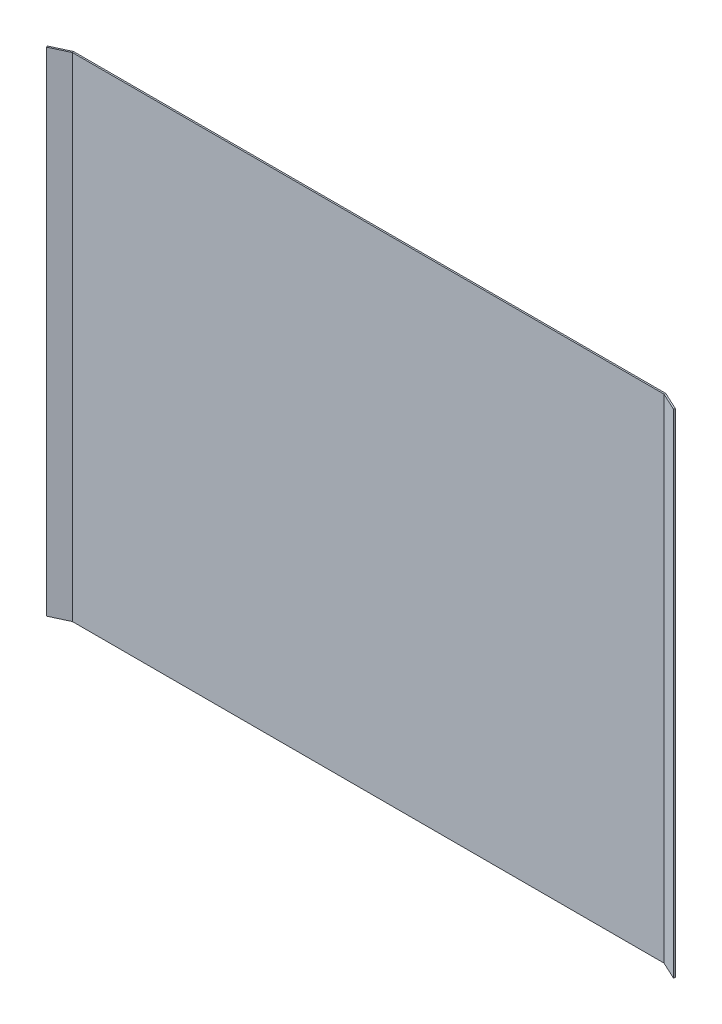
ISO-10303-21;
HEADER;
FILE_DESCRIPTION(('STEP AP214'),'2;1');
FILE_NAME('part.step','',(''),(''),'','','');
FILE_SCHEMA(('AUTOMOTIVE_DESIGN { 1 0 10303 214 1 1 1 1 }'));
ENDSEC;
DATA;
#1=APPLICATION_CONTEXT('core data for automotive mechanical design processes');
#2=APPLICATION_PROTOCOL_DEFINITION('international standard','automotive_design',2000,#1);
#3=PRODUCT_CONTEXT('',#1,'mechanical');
#4=PRODUCT('Part','Part','',(#3));
#5=PRODUCT_RELATED_PRODUCT_CATEGORY('part','',(#4));
#6=PRODUCT_DEFINITION_FORMATION('','',#4);
#7=PRODUCT_DEFINITION_CONTEXT('part definition',#1,'design');
#8=PRODUCT_DEFINITION('design','',#6,#7);
#9=PRODUCT_DEFINITION_SHAPE('','',#8);
#10=(LENGTH_UNIT() NAMED_UNIT(*) SI_UNIT(.MILLI.,.METRE.));
#11=(NAMED_UNIT(*) PLANE_ANGLE_UNIT() SI_UNIT($,.RADIAN.));
#12=(NAMED_UNIT(*) SI_UNIT($,.STERADIAN.) SOLID_ANGLE_UNIT());
#13=UNCERTAINTY_MEASURE_WITH_UNIT(LENGTH_MEASURE(1.E-05),#10,'distance_accuracy_value','');
#14=(GEOMETRIC_REPRESENTATION_CONTEXT(3) GLOBAL_UNCERTAINTY_ASSIGNED_CONTEXT((#13)) GLOBAL_UNIT_ASSIGNED_CONTEXT((#10,
#11,#12)) REPRESENTATION_CONTEXT('',''));
#15=CARTESIAN_POINT('',(0.,0.,0.));
#16=DIRECTION('',(0.,0.,1.));
#17=DIRECTION('',(1.,0.,0.));
#18=AXIS2_PLACEMENT_3D('',#15,#16,#17);
#19=CARTESIAN_POINT('',(0.,1000.,0.));
#20=DIRECTION('',(0.,0.,-1.));
#21=DIRECTION('',(-1.,0.,0.));
#22=AXIS2_PLACEMENT_3D('',#19,#20,#21);
#23=PLANE('',#22);
#24=DIRECTION('',(-1.,0.,0.));
#25=VECTOR('',#24,1.);
#26=CARTESIAN_POINT('',(0.,1000.,0.));
#27=LINE('',#26,#25);
#28=CARTESIAN_POINT('',(1240.,1000.,0.));
#29=VERTEX_POINT('',#28);
#30=CARTESIAN_POINT('',(40.,1000.,2.79997214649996E-08));
#31=VERTEX_POINT('',#30);
#32=EDGE_CURVE('E58',#29,#31,#27,.T.);
#33=ORIENTED_EDGE('',*,*,#32,.F.);
#34=DIRECTION('',(0.,-1.,0.));
#35=VECTOR('',#34,1.);
#36=CARTESIAN_POINT('',(1240.,1000.,0.));
#37=LINE('',#36,#35);
#38=CARTESIAN_POINT('',(1240.,0.,0.));
#39=VERTEX_POINT('',#38);
#40=EDGE_CURVE('E50',#29,#39,#37,.T.);
#41=ORIENTED_EDGE('',*,*,#40,.T.);
#42=DIRECTION('',(1.,0.,0.));
#43=VECTOR('',#42,1.);
#44=CARTESIAN_POINT('',(0.,0.,0.));
#45=LINE('',#44,#43);
#46=CARTESIAN_POINT('',(40.,0.,0.));
#47=VERTEX_POINT('',#46);
#48=EDGE_CURVE('E66',#47,#39,#45,.T.);
#49=ORIENTED_EDGE('',*,*,#48,.F.);
#50=DIRECTION('',(0.,-1.,0.));
#51=VECTOR('',#50,1.);
#52=CARTESIAN_POINT('',(40.,1000.,0.));
#53=LINE('',#52,#51);
#54=EDGE_CURVE('E228',#31,#47,#53,.T.);
#55=ORIENTED_EDGE('',*,*,#54,.F.);
#56=EDGE_LOOP('',(#33,#41,#49,#55));
#57=FACE_BOUND('',#56,.T.);
#58=ADVANCED_FACE('F41',(#57),#23,.T.);
#59=CARTESIAN_POINT('',(0.,1000.,3.));
#60=DIRECTION('',(0.,0.,-1.));
#61=DIRECTION('',(-1.,0.,0.));
#62=AXIS2_PLACEMENT_3D('',#59,#60,#61);
#63=PLANE('',#62);
#64=DIRECTION('',(0.,-1.,0.));
#65=VECTOR('',#64,1.);
#66=CARTESIAN_POINT('',(1240.,1000.,3.));
#67=LINE('',#66,#65);
#68=CARTESIAN_POINT('',(1240.,1000.,2.99999917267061));
#69=VERTEX_POINT('',#68);
#70=CARTESIAN_POINT('',(1240.,0.,3.));
#71=VERTEX_POINT('',#70);
#72=EDGE_CURVE('E232',#69,#71,#67,.T.);
#73=ORIENTED_EDGE('',*,*,#72,.F.);
#74=DIRECTION('',(-1.,0.,0.));
#75=VECTOR('',#74,1.);
#76=CARTESIAN_POINT('',(0.,1000.,3.));
#77=LINE('',#76,#75);
#78=CARTESIAN_POINT('',(40.,1000.,3.00000002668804));
#79=VERTEX_POINT('',#78);
#80=EDGE_CURVE('E45',#69,#79,#77,.T.);
#81=ORIENTED_EDGE('',*,*,#80,.T.);
#82=DIRECTION('',(0.,-1.,0.));
#83=VECTOR('',#82,1.);
#84=CARTESIAN_POINT('',(40.,1000.,3.));
#85=LINE('',#84,#83);
#86=CARTESIAN_POINT('',(40.,0.,3.00000002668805));
#87=VERTEX_POINT('',#86);
#88=EDGE_CURVE('E222',#79,#87,#85,.T.);
#89=ORIENTED_EDGE('',*,*,#88,.T.);
#90=DIRECTION('',(1.,0.,0.));
#91=VECTOR('',#90,1.);
#92=CARTESIAN_POINT('',(0.,0.,3.));
#93=LINE('',#92,#91);
#94=EDGE_CURVE('E240',#87,#71,#93,.T.);
#95=ORIENTED_EDGE('',*,*,#94,.T.);
#96=EDGE_LOOP('',(#73,#81,#89,#95));
#97=FACE_BOUND('',#96,.T.);
#98=ADVANCED_FACE('F245',(#97),#63,.F.);
#99=CARTESIAN_POINT('',(0.,1000.,3.));
#100=DIRECTION('',(0.,-1.,0.));
#101=DIRECTION('',(0.,0.,-1.));
#102=AXIS2_PLACEMENT_3D('',#99,#100,#101);
#103=PLANE('',#102);
#104=DIRECTION('',(0.,0.,1.));
#105=VECTOR('',#104,1.);
#106=CARTESIAN_POINT('',(1240.,1000.,3.));
#107=LINE('',#106,#105);
#108=EDGE_CURVE('E12',#29,#69,#107,.T.);
#109=ORIENTED_EDGE('',*,*,#108,.F.);
#110=ORIENTED_EDGE('',*,*,#32,.T.);
#111=DIRECTION('',(0.,0.,1.));
#112=VECTOR('',#111,1.);
#113=CARTESIAN_POINT('',(40.,1000.,3.));
#114=LINE('',#113,#112);
#115=EDGE_CURVE('E225',#31,#79,#114,.T.);
#116=ORIENTED_EDGE('',*,*,#115,.T.);
#117=ORIENTED_EDGE('',*,*,#80,.F.);
#118=EDGE_LOOP('',(#109,#110,#116,#117));
#119=FACE_BOUND('',#118,.T.);
#120=ADVANCED_FACE('F43',(#119),#103,.F.);
#121=CARTESIAN_POINT('',(0.,0.,3.));
#122=DIRECTION('',(0.,1.,0.));
#123=DIRECTION('',(0.,0.,1.));
#124=AXIS2_PLACEMENT_3D('',#121,#122,#123);
#125=PLANE('',#124);
#126=DIRECTION('',(0.,0.,-1.));
#127=VECTOR('',#126,1.);
#128=CARTESIAN_POINT('',(1240.,0.,3.));
#129=LINE('',#128,#127);
#130=EDGE_CURVE('E235',#71,#39,#129,.T.);
#131=ORIENTED_EDGE('',*,*,#130,.F.);
#132=ORIENTED_EDGE('',*,*,#94,.F.);
#133=DIRECTION('',(0.,0.,-1.));
#134=VECTOR('',#133,1.);
#135=CARTESIAN_POINT('',(40.0000000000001,0.,3.));
#136=LINE('',#135,#134);
#137=EDGE_CURVE('E230',#87,#47,#136,.T.);
#138=ORIENTED_EDGE('',*,*,#137,.T.);
#139=ORIENTED_EDGE('',*,*,#48,.T.);
#140=EDGE_LOOP('',(#131,#132,#138,#139));
#141=FACE_BOUND('',#140,.T.);
#142=ADVANCED_FACE('F286',(#141),#125,.F.);
#143=CARTESIAN_POINT('',(40.,1000.,4.09999997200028));
#144=DIRECTION('',(0.,-1.,0.));
#145=DIRECTION('',(0.,0.,-1.));
#146=AXIS2_PLACEMENT_3D('',#143,#144,#145);
#147=PLANE('',#146);
#148=ORIENTED_EDGE('',*,*,#115,.F.);
#149=CARTESIAN_POINT('',(40.,1000.,4.1));
#150=DIRECTION('',(0.,-1.,0.));
#151=DIRECTION('',(1.,0.,0.));
#152=AXIS2_PLACEMENT_3D('',#149,#150,#151);
#153=CIRCLE('',#152,4.09999997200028);
#154=CARTESIAN_POINT('',(38.2672651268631,1000.,0.384138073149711));
#155=VERTEX_POINT('',#154);
#156=EDGE_CURVE('E180',#31,#155,#153,.F.);
#157=ORIENTED_EDGE('',*,*,#156,.T.);
#158=DIRECTION('',(0.4226182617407,0.,0.90630778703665));
#159=VECTOR('',#158,1.);
#160=CARTESIAN_POINT('',(39.5351199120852,1000.,3.10306143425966));
#161=LINE('',#160,#159);
#162=CARTESIAN_POINT('',(39.5351199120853,1000.,3.10306143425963));
#163=VERTEX_POINT('',#162);
#164=EDGE_CURVE('E203',#155,#163,#161,.T.);
#165=ORIENTED_EDGE('',*,*,#164,.T.);
#166=CARTESIAN_POINT('',(40.,1000.,4.09999997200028));
#167=DIRECTION('',(0.,1.,0.));
#168=DIRECTION('',(0.,0.,1.));
#169=AXIS2_PLACEMENT_3D('',#166,#167,#168);
#170=CIRCLE('',#169,1.09999994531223);
#171=EDGE_CURVE('E214',#79,#163,#170,.T.);
#172=ORIENTED_EDGE('',*,*,#171,.F.);
#173=EDGE_LOOP('',(#148,#157,#165,#172));
#174=FACE_BOUND('',#173,.T.);
#175=ADVANCED_FACE('F250',(#174),#147,.F.);
#176=CARTESIAN_POINT('',(40.0000000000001,0.,4.09999997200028));
#177=DIRECTION('',(0.,1.,0.));
#178=DIRECTION('',(-1.,0.,0.));
#179=AXIS2_PLACEMENT_3D('',#176,#177,#178);
#180=PLANE('',#179);
#181=DIRECTION('',(-0.4226182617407,0.,-0.90630778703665));
#182=VECTOR('',#181,1.);
#183=CARTESIAN_POINT('',(39.5351199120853,0.,3.10306143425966));
#184=LINE('',#183,#182);
#185=CARTESIAN_POINT('',(39.5351199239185,0.,3.10306145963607));
#186=VERTEX_POINT('',#185);
#187=CARTESIAN_POINT('',(38.2672651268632,0.,0.384138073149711));
#188=VERTEX_POINT('',#187);
#189=EDGE_CURVE('E206',#186,#188,#184,.T.);
#190=ORIENTED_EDGE('',*,*,#189,.T.);
#191=CARTESIAN_POINT('',(40.0000000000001,0.,4.1));
#192=DIRECTION('',(0.,-1.,0.));
#193=DIRECTION('',(1.,0.,0.));
#194=AXIS2_PLACEMENT_3D('',#191,#192,#193);
#195=CIRCLE('',#194,4.09999997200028);
#196=EDGE_CURVE('E211',#188,#47,#195,.T.);
#197=ORIENTED_EDGE('',*,*,#196,.T.);
#198=ORIENTED_EDGE('',*,*,#137,.F.);
#199=CARTESIAN_POINT('',(40.0000000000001,0.,4.09999997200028));
#200=DIRECTION('',(0.,-1.,0.));
#201=DIRECTION('',(1.,0.,0.));
#202=AXIS2_PLACEMENT_3D('',#199,#200,#201);
#203=CIRCLE('',#202,1.09999994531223);
#204=EDGE_CURVE('E219',#186,#87,#203,.T.);
#205=ORIENTED_EDGE('',*,*,#204,.F.);
#206=EDGE_LOOP('',(#190,#197,#198,#205));
#207=FACE_BOUND('',#206,.T.);
#208=ADVANCED_FACE('F261',(#207),#180,.F.);
#209=CARTESIAN_POINT('',(39.9999999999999,1500.00491580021,4.1));
#210=DIRECTION('',(0.,-1.,0.));
#211=DIRECTION('',(1.,0.,0.));
#212=AXIS2_PLACEMENT_3D('',#209,#210,#211);
#213=CYLINDRICAL_SURFACE('',#212,1.09999997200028);
#214=ORIENTED_EDGE('',*,*,#204,.T.);
#215=ORIENTED_EDGE('',*,*,#88,.F.);
#216=ORIENTED_EDGE('',*,*,#171,.T.);
#217=DIRECTION('',(0.,-1.,0.));
#218=VECTOR('',#217,1.);
#219=CARTESIAN_POINT('',(39.5351199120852,1000.,3.10306143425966));
#220=LINE('',#219,#218);
#221=EDGE_CURVE('E177',#163,#186,#220,.T.);
#222=ORIENTED_EDGE('',*,*,#221,.T.);
#223=EDGE_LOOP('',(#214,#215,#216,#222));
#224=FACE_BOUND('',#223,.T.);
#225=ADVANCED_FACE('F270',(#224),#213,.F.);
#226=CARTESIAN_POINT('',(39.9999999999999,1500.00491580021,4.1));
#227=DIRECTION('',(0.,-1.,0.));
#228=DIRECTION('',(1.,0.,0.));
#229=AXIS2_PLACEMENT_3D('',#226,#227,#228);
#230=CYLINDRICAL_SURFACE('',#229,4.09999997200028);
#231=ORIENTED_EDGE('',*,*,#196,.F.);
#232=DIRECTION('',(0.,-1.,0.));
#233=VECTOR('',#232,1.);
#234=CARTESIAN_POINT('',(38.2672651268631,1000.,0.384138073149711));
#235=LINE('',#234,#233);
#236=EDGE_CURVE('E184',#155,#188,#235,.T.);
#237=ORIENTED_EDGE('',*,*,#236,.F.);
#238=ORIENTED_EDGE('',*,*,#156,.F.);
#239=ORIENTED_EDGE('',*,*,#54,.T.);
#240=EDGE_LOOP('',(#231,#237,#238,#239));
#241=FACE_BOUND('',#240,.T.);
#242=ADVANCED_FACE('F254',(#241),#230,.T.);
#243=CARTESIAN_POINT('',(4.10930180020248,0.,19.6223917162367));
#244=DIRECTION('',(0.90630778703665,0.,-0.4226182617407));
#245=DIRECTION('',(-0.4226182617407,0.,-0.90630778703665));
#246=AXIS2_PLACEMENT_3D('',#243,#244,#245);
#247=PLANE('',#246);
#248=DIRECTION('',(0.,-1.,0.));
#249=VECTOR('',#248,1.);
#250=CARTESIAN_POINT('',(2.84144701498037,0.,16.9034683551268));
#251=LINE('',#250,#249);
#252=CARTESIAN_POINT('',(2.84144701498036,1000.,16.9034683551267));
#253=VERTEX_POINT('',#252);
#254=CARTESIAN_POINT('',(2.84144701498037,0.,16.9034683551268));
#255=VERTEX_POINT('',#254);
#256=EDGE_CURVE('E200',#253,#255,#251,.T.);
#257=ORIENTED_EDGE('',*,*,#256,.T.);
#258=DIRECTION('',(-0.4226182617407,0.,-0.90630778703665));
#259=VECTOR('',#258,1.);
#260=CARTESIAN_POINT('',(4.10930180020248,0.,19.6223917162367));
#261=LINE('',#260,#259);
#262=CARTESIAN_POINT('',(4.10930180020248,0.,19.6223917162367));
#263=VERTEX_POINT('',#262);
#264=EDGE_CURVE('E181',#263,#255,#261,.T.);
#265=ORIENTED_EDGE('',*,*,#264,.F.);
#266=DIRECTION('',(0.,-1.,0.));
#267=VECTOR('',#266,1.);
#268=CARTESIAN_POINT('',(4.10930180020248,0.,19.6223917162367));
#269=LINE('',#268,#267);
#270=CARTESIAN_POINT('',(4.10930180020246,1000.,19.6223917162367));
#271=VERTEX_POINT('',#270);
#272=EDGE_CURVE('E192',#271,#263,#269,.T.);
#273=ORIENTED_EDGE('',*,*,#272,.F.);
#274=DIRECTION('',(-0.4226182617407,0.,-0.90630778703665));
#275=VECTOR('',#274,1.);
#276=CARTESIAN_POINT('',(4.10930180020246,1000.,19.6223917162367));
#277=LINE('',#276,#275);
#278=EDGE_CURVE('E197',#271,#253,#277,.T.);
#279=ORIENTED_EDGE('',*,*,#278,.T.);
#280=EDGE_LOOP('',(#257,#265,#273,#279));
#281=FACE_BOUND('',#280,.T.);
#282=ADVANCED_FACE('F277',(#281),#247,.F.);
#283=CARTESIAN_POINT('',(4.10930180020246,1000.,19.6223917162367));
#284=DIRECTION('',(-0.4226182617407,0.,-0.90630778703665));
#285=DIRECTION('',(-0.90630778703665,0.,0.4226182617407));
#286=AXIS2_PLACEMENT_3D('',#283,#284,#285);
#287=PLANE('',#286);
#288=ORIENTED_EDGE('',*,*,#221,.F.);
#289=DIRECTION('',(-0.90630778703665,0.,0.4226182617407));
#290=VECTOR('',#289,1.);
#291=CARTESIAN_POINT('',(4.10930180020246,1000.,19.6223917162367));
#292=LINE('',#291,#290);
#293=EDGE_CURVE('E195',#163,#271,#292,.T.);
#294=ORIENTED_EDGE('',*,*,#293,.T.);
#295=ORIENTED_EDGE('',*,*,#272,.T.);
#296=DIRECTION('',(0.90630778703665,0.,-0.4226182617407));
#297=VECTOR('',#296,1.);
#298=CARTESIAN_POINT('',(4.10930180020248,0.,19.6223917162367));
#299=LINE('',#298,#297);
#300=EDGE_CURVE('E189',#263,#186,#299,.T.);
#301=ORIENTED_EDGE('',*,*,#300,.T.);
#302=EDGE_LOOP('',(#288,#294,#295,#301));
#303=FACE_BOUND('',#302,.T.);
#304=ADVANCED_FACE('F265',(#303),#287,.F.);
#305=CARTESIAN_POINT('',(4.10930180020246,1000.,19.6223917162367));
#306=DIRECTION('',(0.,-1.,0.));
#307=DIRECTION('',(-0.4226182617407,0.,-0.90630778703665));
#308=AXIS2_PLACEMENT_3D('',#305,#306,#307);
#309=PLANE('',#308);
#310=ORIENTED_EDGE('',*,*,#164,.F.);
#311=DIRECTION('',(-0.90630778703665,0.,0.4226182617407));
#312=VECTOR('',#311,1.);
#313=CARTESIAN_POINT('',(2.84144701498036,1000.,16.9034683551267));
#314=LINE('',#313,#312);
#315=EDGE_CURVE('E187',#155,#253,#314,.T.);
#316=ORIENTED_EDGE('',*,*,#315,.T.);
#317=ORIENTED_EDGE('',*,*,#278,.F.);
#318=ORIENTED_EDGE('',*,*,#293,.F.);
#319=EDGE_LOOP('',(#310,#316,#317,#318));
#320=FACE_BOUND('',#319,.T.);
#321=ADVANCED_FACE('F333',(#320),#309,.F.);
#322=CARTESIAN_POINT('',(2.84144701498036,1000.,16.9034683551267));
#323=DIRECTION('',(-0.4226182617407,0.,-0.90630778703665));
#324=DIRECTION('',(-0.90630778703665,0.,0.4226182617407));
#325=AXIS2_PLACEMENT_3D('',#322,#323,#324);
#326=PLANE('',#325);
#327=ORIENTED_EDGE('',*,*,#315,.F.);
#328=ORIENTED_EDGE('',*,*,#236,.T.);
#329=DIRECTION('',(0.90630778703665,0.,-0.4226182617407));
#330=VECTOR('',#329,1.);
#331=CARTESIAN_POINT('',(2.84144701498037,0.,16.9034683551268));
#332=LINE('',#331,#330);
#333=EDGE_CURVE('E178',#255,#188,#332,.T.);
#334=ORIENTED_EDGE('',*,*,#333,.F.);
#335=ORIENTED_EDGE('',*,*,#256,.F.);
#336=EDGE_LOOP('',(#327,#328,#334,#335));
#337=FACE_BOUND('',#336,.T.);
#338=ADVANCED_FACE('F256',(#337),#326,.T.);
#339=CARTESIAN_POINT('',(4.10930180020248,0.,19.6223917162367));
#340=DIRECTION('',(0.,1.,0.));
#341=DIRECTION('',(0.4226182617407,0.,0.90630778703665));
#342=AXIS2_PLACEMENT_3D('',#339,#340,#341);
#343=PLANE('',#342);
#344=ORIENTED_EDGE('',*,*,#189,.F.);
#345=ORIENTED_EDGE('',*,*,#300,.F.);
#346=ORIENTED_EDGE('',*,*,#264,.T.);
#347=ORIENTED_EDGE('',*,*,#333,.T.);
#348=EDGE_LOOP('',(#344,#345,#346,#347));
#349=FACE_BOUND('',#348,.T.);
#350=ADVANCED_FACE('F263',(#349),#343,.F.);
#351=CARTESIAN_POINT('',(1240.,1000.,4.10000086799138));
#352=DIRECTION('',(0.,-1.,0.));
#353=DIRECTION('',(0.,0.,-1.));
#354=AXIS2_PLACEMENT_3D('',#351,#352,#353);
#355=PLANE('',#354);
#356=DIRECTION('',(-0.4226182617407,0.,0.90630778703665));
#357=VECTOR('',#356,1.);
#358=CARTESIAN_POINT('',(1240.46488008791,1000.,3.10306143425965));
#359=LINE('',#358,#357);
#360=CARTESIAN_POINT('',(1241.73273487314,1000.,0.384138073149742));
#361=VERTEX_POINT('',#360);
#362=CARTESIAN_POINT('',(1240.46488045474,1000.,3.10306064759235));
#363=VERTEX_POINT('',#362);
#364=EDGE_CURVE('E508',#361,#363,#359,.T.);
#365=ORIENTED_EDGE('',*,*,#364,.F.);
#366=CARTESIAN_POINT('',(1240.,1000.,4.1));
#367=DIRECTION('',(0.,1.,0.));
#368=DIRECTION('',(0.,0.,1.));
#369=AXIS2_PLACEMENT_3D('',#366,#367,#368);
#370=CIRCLE('',#369,4.10000086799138);
#371=EDGE_CURVE('E164',#361,#29,#370,.T.);
#372=ORIENTED_EDGE('',*,*,#371,.T.);
#373=ORIENTED_EDGE('',*,*,#108,.T.);
#374=CARTESIAN_POINT('',(1240.,1000.,4.10000086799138));
#375=DIRECTION('',(0.,1.,0.));
#376=DIRECTION('',(0.,0.,1.));
#377=AXIS2_PLACEMENT_3D('',#374,#375,#376);
#378=CIRCLE('',#377,1.10000169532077);
#379=EDGE_CURVE('E171',#363,#69,#378,.T.);
#380=ORIENTED_EDGE('',*,*,#379,.F.);
#381=EDGE_LOOP('',(#365,#372,#373,#380));
#382=FACE_BOUND('',#381,.T.);
#383=ADVANCED_FACE('F362',(#382),#355,.F.);
#384=CARTESIAN_POINT('',(1240.,0.,4.10000086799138));
#385=DIRECTION('',(0.,1.,0.));
#386=DIRECTION('',(0.,0.,1.));
#387=AXIS2_PLACEMENT_3D('',#384,#385,#386);
#388=PLANE('',#387);
#389=CARTESIAN_POINT('',(1240.,0.,4.1));
#390=DIRECTION('',(0.,1.,0.));
#391=DIRECTION('',(0.,0.,1.));
#392=AXIS2_PLACEMENT_3D('',#389,#390,#391);
#393=CIRCLE('',#392,4.10000086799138);
#394=CARTESIAN_POINT('',(1241.73273487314,0.,0.384138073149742));
#395=VERTEX_POINT('',#394);
#396=EDGE_CURVE('E167',#39,#395,#393,.F.);
#397=ORIENTED_EDGE('',*,*,#396,.T.);
#398=DIRECTION('',(0.4226182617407,0.,-0.90630778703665));
#399=VECTOR('',#398,1.);
#400=CARTESIAN_POINT('',(1240.46488008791,0.,3.10306143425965));
#401=LINE('',#400,#399);
#402=CARTESIAN_POINT('',(1240.46488008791,0.,3.10306143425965));
#403=VERTEX_POINT('',#402);
#404=EDGE_CURVE('E142',#403,#395,#401,.T.);
#405=ORIENTED_EDGE('',*,*,#404,.F.);
#406=CARTESIAN_POINT('',(1240.,0.,4.10000086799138));
#407=DIRECTION('',(0.,-1.,0.));
#408=DIRECTION('',(0.,0.,-1.));
#409=AXIS2_PLACEMENT_3D('',#406,#407,#408);
#410=CIRCLE('',#409,1.10000169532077);
#411=EDGE_CURVE('E174',#71,#403,#410,.T.);
#412=ORIENTED_EDGE('',*,*,#411,.F.);
#413=ORIENTED_EDGE('',*,*,#130,.T.);
#414=EDGE_LOOP('',(#397,#405,#412,#413));
#415=FACE_BOUND('',#414,.T.);
#416=ADVANCED_FACE('F372',(#415),#388,.F.);
#417=CARTESIAN_POINT('',(1240.,-500.004915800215,4.1));
#418=DIRECTION('',(0.,1.,0.));
#419=DIRECTION('',(0.,0.,1.));
#420=AXIS2_PLACEMENT_3D('',#417,#418,#419);
#421=CYLINDRICAL_SURFACE('',#420,1.10000086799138);
#422=ORIENTED_EDGE('',*,*,#72,.T.);
#423=ORIENTED_EDGE('',*,*,#411,.T.);
#424=DIRECTION('',(0.,-1.,0.));
#425=VECTOR('',#424,1.);
#426=CARTESIAN_POINT('',(1240.46488008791,1000.,3.10306143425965));
#427=LINE('',#426,#425);
#428=EDGE_CURVE('E518',#363,#403,#427,.T.);
#429=ORIENTED_EDGE('',*,*,#428,.F.);
#430=ORIENTED_EDGE('',*,*,#379,.T.);
#431=EDGE_LOOP('',(#422,#423,#429,#430));
#432=FACE_BOUND('',#431,.T.);
#433=ADVANCED_FACE('F375',(#432),#421,.F.);
#434=CARTESIAN_POINT('',(1240.,-500.004915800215,4.1));
#435=DIRECTION('',(0.,1.,0.));
#436=DIRECTION('',(0.,0.,1.));
#437=AXIS2_PLACEMENT_3D('',#434,#435,#436);
#438=CYLINDRICAL_SURFACE('',#437,4.10000086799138);
#439=ORIENTED_EDGE('',*,*,#40,.F.);
#440=ORIENTED_EDGE('',*,*,#371,.F.);
#441=DIRECTION('',(0.,-1.,0.));
#442=VECTOR('',#441,1.);
#443=CARTESIAN_POINT('',(1241.73273487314,1000.,0.384138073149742));
#444=LINE('',#443,#442);
#445=EDGE_CURVE('E159',#361,#395,#444,.T.);
#446=ORIENTED_EDGE('',*,*,#445,.T.);
#447=ORIENTED_EDGE('',*,*,#396,.F.);
#448=EDGE_LOOP('',(#439,#440,#446,#447));
#449=FACE_BOUND('',#448,.T.);
#450=ADVANCED_FACE('F386',(#449),#438,.T.);
#451=CARTESIAN_POINT('',(1275.8906981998,0.,19.6223917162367));
#452=DIRECTION('',(-0.90630778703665,0.,-0.4226182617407));
#453=DIRECTION('',(-0.4226182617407,0.,0.90630778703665));
#454=AXIS2_PLACEMENT_3D('',#451,#452,#453);
#455=PLANE('',#454);
#456=DIRECTION('',(0.,1.,0.));
#457=VECTOR('',#456,1.);
#458=CARTESIAN_POINT('',(1277.15855298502,0.,16.9034683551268));
#459=LINE('',#458,#457);
#460=CARTESIAN_POINT('',(1277.15855298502,0.,16.9034683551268));
#461=VERTEX_POINT('',#460);
#462=CARTESIAN_POINT('',(1277.15855298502,1000.,16.9034683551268));
#463=VERTEX_POINT('',#462);
#464=EDGE_CURVE('E152',#461,#463,#459,.T.);
#465=ORIENTED_EDGE('',*,*,#464,.T.);
#466=DIRECTION('',(0.4226182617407,0.,-0.90630778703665));
#467=VECTOR('',#466,1.);
#468=CARTESIAN_POINT('',(1275.8906981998,1000.,19.6223917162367));
#469=LINE('',#468,#467);
#470=CARTESIAN_POINT('',(1275.8906981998,1000.,19.6223917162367));
#471=VERTEX_POINT('',#470);
#472=EDGE_CURVE('E168',#471,#463,#469,.T.);
#473=ORIENTED_EDGE('',*,*,#472,.F.);
#474=DIRECTION('',(0.,1.,0.));
#475=VECTOR('',#474,1.);
#476=CARTESIAN_POINT('',(1275.8906981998,0.,19.6223917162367));
#477=LINE('',#476,#475);
#478=CARTESIAN_POINT('',(1275.8906981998,0.,19.6223917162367));
#479=VERTEX_POINT('',#478);
#480=EDGE_CURVE('E154',#479,#471,#477,.T.);
#481=ORIENTED_EDGE('',*,*,#480,.F.);
#482=DIRECTION('',(0.4226182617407,0.,-0.90630778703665));
#483=VECTOR('',#482,1.);
#484=CARTESIAN_POINT('',(1275.8906981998,0.,19.6223917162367));
#485=LINE('',#484,#483);
#486=EDGE_CURVE('E139',#479,#461,#485,.T.);
#487=ORIENTED_EDGE('',*,*,#486,.T.);
#488=EDGE_LOOP('',(#465,#473,#481,#487));
#489=FACE_BOUND('',#488,.T.);
#490=ADVANCED_FACE('F150',(#489),#455,.F.);
#491=CARTESIAN_POINT('',(115.816730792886,1000.,-521.32898331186));
#492=DIRECTION('',(0.4226182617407,0.,-0.90630778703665));
#493=DIRECTION('',(-0.90630778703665,0.,-0.4226182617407));
#494=AXIS2_PLACEMENT_3D('',#491,#492,#493);
#495=PLANE('',#494);
#496=DIRECTION('',(-0.90630778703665,0.,-0.4226182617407));
#497=VECTOR('',#496,1.);
#498=CARTESIAN_POINT('',(115.816730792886,1000.,-521.32898331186));
#499=LINE('',#498,#497);
#500=EDGE_CURVE('E155',#471,#363,#499,.T.);
#501=ORIENTED_EDGE('',*,*,#500,.T.);
#502=ORIENTED_EDGE('',*,*,#428,.T.);
#503=DIRECTION('',(0.90630778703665,0.,0.4226182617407));
#504=VECTOR('',#503,1.);
#505=CARTESIAN_POINT('',(115.816730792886,0.,-521.32898331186));
#506=LINE('',#505,#504);
#507=EDGE_CURVE('E519',#403,#479,#506,.T.);
#508=ORIENTED_EDGE('',*,*,#507,.T.);
#509=ORIENTED_EDGE('',*,*,#480,.T.);
#510=EDGE_LOOP('',(#501,#502,#508,#509));
#511=FACE_BOUND('',#510,.T.);
#512=ADVANCED_FACE('F415',(#511),#495,.F.);
#513=CARTESIAN_POINT('',(115.816730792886,0.,-521.32898331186));
#514=DIRECTION('',(0.,1.,0.));
#515=DIRECTION('',(-0.4226182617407,0.,0.90630778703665));
#516=AXIS2_PLACEMENT_3D('',#513,#514,#515);
#517=PLANE('',#516);
#518=ORIENTED_EDGE('',*,*,#507,.F.);
#519=ORIENTED_EDGE('',*,*,#404,.T.);
#520=DIRECTION('',(0.90630778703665,0.,0.4226182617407));
#521=VECTOR('',#520,1.);
#522=CARTESIAN_POINT('',(117.084585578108,0.,-524.047906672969));
#523=LINE('',#522,#521);
#524=EDGE_CURVE('E135',#395,#461,#523,.T.);
#525=ORIENTED_EDGE('',*,*,#524,.T.);
#526=ORIENTED_EDGE('',*,*,#486,.F.);
#527=EDGE_LOOP('',(#518,#519,#525,#526));
#528=FACE_BOUND('',#527,.T.);
#529=ADVANCED_FACE('F138',(#528),#517,.F.);
#530=CARTESIAN_POINT('',(117.084585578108,1000.,-524.047906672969));
#531=DIRECTION('',(0.4226182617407,0.,-0.90630778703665));
#532=DIRECTION('',(-0.90630778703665,0.,-0.4226182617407));
#533=AXIS2_PLACEMENT_3D('',#530,#531,#532);
#534=PLANE('',#533);
#535=ORIENTED_EDGE('',*,*,#445,.F.);
#536=DIRECTION('',(-0.90630778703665,0.,-0.4226182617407));
#537=VECTOR('',#536,1.);
#538=CARTESIAN_POINT('',(117.084585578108,1000.,-524.047906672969));
#539=LINE('',#538,#537);
#540=EDGE_CURVE('E147',#463,#361,#539,.T.);
#541=ORIENTED_EDGE('',*,*,#540,.F.);
#542=ORIENTED_EDGE('',*,*,#464,.F.);
#543=ORIENTED_EDGE('',*,*,#524,.F.);
#544=EDGE_LOOP('',(#535,#541,#542,#543));
#545=FACE_BOUND('',#544,.T.);
#546=ADVANCED_FACE('F158',(#545),#534,.T.);
#547=CARTESIAN_POINT('',(115.816730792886,1000.,-521.32898331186));
#548=DIRECTION('',(0.,-1.,0.));
#549=DIRECTION('',(0.4226182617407,0.,-0.90630778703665));
#550=AXIS2_PLACEMENT_3D('',#547,#548,#549);
#551=PLANE('',#550);
#552=ORIENTED_EDGE('',*,*,#540,.T.);
#553=ORIENTED_EDGE('',*,*,#364,.T.);
#554=ORIENTED_EDGE('',*,*,#500,.F.);
#555=ORIENTED_EDGE('',*,*,#472,.T.);
#556=EDGE_LOOP('',(#552,#553,#554,#555));
#557=FACE_BOUND('',#556,.T.);
#558=ADVANCED_FACE('F443',(#557),#551,.F.);
#559=CLOSED_SHELL('',(#58,#98,#120,#142,#175,#208,#225,#242,#282,#304,#321,#338,#350,#383,#416,
#433,#450,#490,#512,#529,#546,#558));
#560=MANIFOLD_SOLID_BREP('B2',#559);
#561=ADVANCED_BREP_SHAPE_REPRESENTATION('',(#18,#560),#14);
#562=SHAPE_DEFINITION_REPRESENTATION(#9,#561);
ENDSEC;
END-ISO-10303-21;
